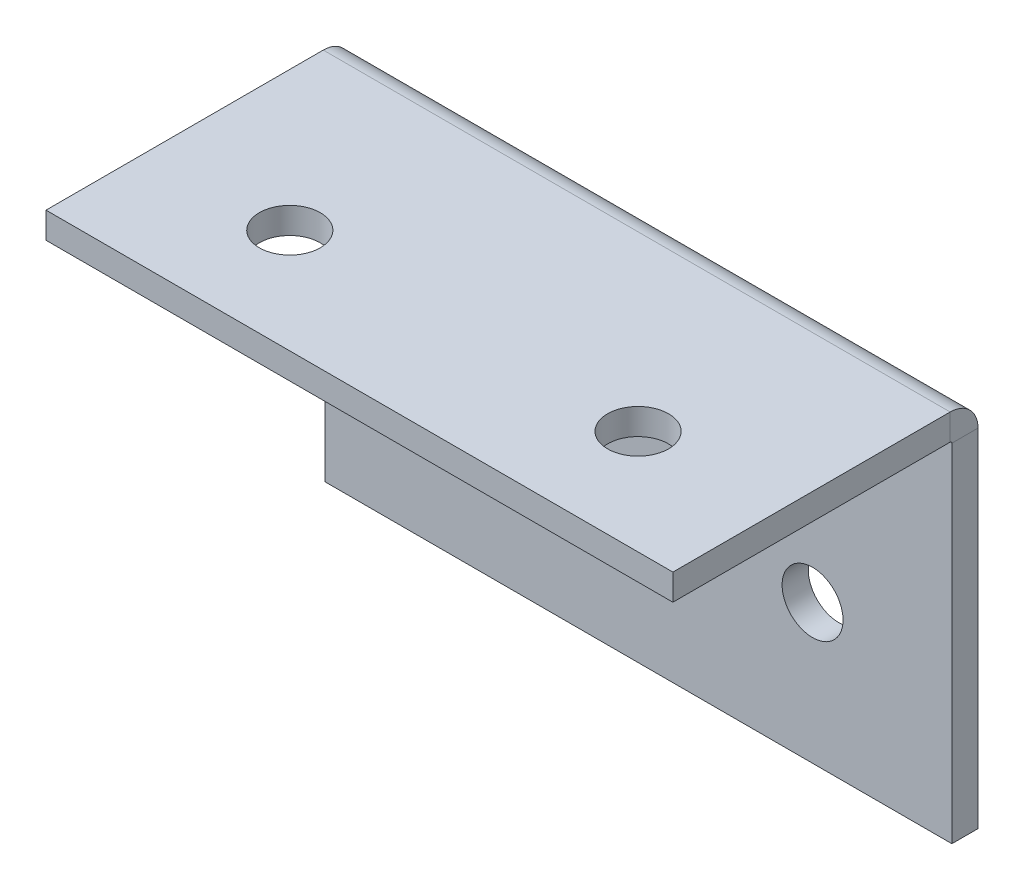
ISO-10303-21;
HEADER;
FILE_DESCRIPTION(('STEP AP214'),'2;1');
FILE_NAME('part.step','',(''),(''),'','','');
FILE_SCHEMA(('AUTOMOTIVE_DESIGN { 1 0 10303 214 1 1 1 1 }'));
ENDSEC;
DATA;
#1=APPLICATION_CONTEXT('core data for automotive mechanical design processes');
#2=APPLICATION_PROTOCOL_DEFINITION('international standard','automotive_design',2000,#1);
#3=PRODUCT_CONTEXT('',#1,'mechanical');
#4=PRODUCT('Part','Part','',(#3));
#5=PRODUCT_RELATED_PRODUCT_CATEGORY('part','',(#4));
#6=PRODUCT_DEFINITION_FORMATION('','',#4);
#7=PRODUCT_DEFINITION_CONTEXT('part definition',#1,'design');
#8=PRODUCT_DEFINITION('design','',#6,#7);
#9=PRODUCT_DEFINITION_SHAPE('','',#8);
#10=(LENGTH_UNIT() NAMED_UNIT(*) SI_UNIT(.MILLI.,.METRE.));
#11=(NAMED_UNIT(*) PLANE_ANGLE_UNIT() SI_UNIT($,.RADIAN.));
#12=(NAMED_UNIT(*) SI_UNIT($,.STERADIAN.) SOLID_ANGLE_UNIT());
#13=UNCERTAINTY_MEASURE_WITH_UNIT(LENGTH_MEASURE(1.E-05),#10,'distance_accuracy_value','');
#14=(GEOMETRIC_REPRESENTATION_CONTEXT(3) GLOBAL_UNCERTAINTY_ASSIGNED_CONTEXT((#13)) GLOBAL_UNIT_ASSIGNED_CONTEXT((#10,
#11,#12)) REPRESENTATION_CONTEXT('',''));
#15=CARTESIAN_POINT('',(0.,0.,0.));
#16=DIRECTION('',(0.,0.,1.));
#17=DIRECTION('',(1.,0.,0.));
#18=AXIS2_PLACEMENT_3D('',#15,#16,#17);
#19=CARTESIAN_POINT('',(0.,20.0214484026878,16.0214484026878));
#20=DIRECTION('',(0.,1.,0.));
#21=DIRECTION('',(-1.,0.,0.));
#22=AXIS2_PLACEMENT_3D('',#19,#20,#21);
#23=PLANE('',#22);
#24=CARTESIAN_POINT('',(8.,20.0214484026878,10.0214484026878));
#25=DIRECTION('',(0.,-1.,0.));
#26=DIRECTION('',(1.,0.,0.));
#27=AXIS2_PLACEMENT_3D('',#24,#25,#26);
#28=CIRCLE('',#27,1.75);
#29=CARTESIAN_POINT('',(9.75,20.0214484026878,10.0214484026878));
#30=VERTEX_POINT('',#29);
#31=EDGE_CURVE('E162',#30,#30,#28,.T.);
#32=ORIENTED_EDGE('',*,*,#31,.F.);
#33=EDGE_LOOP('',(#32));
#34=FACE_BOUND('',#33,.T.);
#35=CARTESIAN_POINT('',(28.,20.0214484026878,10.0214484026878));
#36=DIRECTION('',(0.,-1.,0.));
#37=DIRECTION('',(1.,0.,0.));
#38=AXIS2_PLACEMENT_3D('',#35,#36,#37);
#39=CIRCLE('',#38,1.75);
#40=CARTESIAN_POINT('',(29.75,20.0214484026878,10.0214484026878));
#41=VERTEX_POINT('',#40);
#42=EDGE_CURVE('E163',#41,#41,#39,.T.);
#43=ORIENTED_EDGE('',*,*,#42,.F.);
#44=EDGE_LOOP('',(#43));
#45=FACE_BOUND('',#44,.T.);
#46=DIRECTION('',(0.,0.,-1.));
#47=VECTOR('',#46,1.);
#48=CARTESIAN_POINT('',(0.,20.0214484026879,-19.9785515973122));
#49=LINE('',#48,#47);
#50=CARTESIAN_POINT('',(0.,20.0214484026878,16.0214484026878));
#51=VERTEX_POINT('',#50);
#52=CARTESIAN_POINT('',(0.,20.0214484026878,0.099999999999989));
#53=VERTEX_POINT('',#52);
#54=EDGE_CURVE('E53',#51,#53,#49,.T.);
#55=ORIENTED_EDGE('',*,*,#54,.T.);
#56=DIRECTION('',(1.,0.,0.));
#57=VECTOR('',#56,1.);
#58=CARTESIAN_POINT('',(0.,20.0214484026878,0.099999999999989));
#59=LINE('',#58,#57);
#60=CARTESIAN_POINT('',(36.,20.0214484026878,0.099999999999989));
#61=VERTEX_POINT('',#60);
#62=EDGE_CURVE('E45',#53,#61,#59,.T.);
#63=ORIENTED_EDGE('',*,*,#62,.T.);
#64=DIRECTION('',(0.,0.,1.));
#65=VECTOR('',#64,1.);
#66=CARTESIAN_POINT('',(36.,20.0214484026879,-19.9785515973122));
#67=LINE('',#66,#65);
#68=CARTESIAN_POINT('',(36.,20.0214484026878,16.0214484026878));
#69=VERTEX_POINT('',#68);
#70=EDGE_CURVE('E61',#61,#69,#67,.T.);
#71=ORIENTED_EDGE('',*,*,#70,.T.);
#72=DIRECTION('',(-1.,0.,0.));
#73=VECTOR('',#72,1.);
#74=CARTESIAN_POINT('',(0.,20.0214484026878,16.0214484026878));
#75=LINE('',#74,#73);
#76=EDGE_CURVE('E176',#69,#51,#75,.T.);
#77=ORIENTED_EDGE('',*,*,#76,.T.);
#78=EDGE_LOOP('',(#55,#63,#71,#77));
#79=FACE_BOUND('',#78,.T.);
#80=ADVANCED_FACE('F36',(#34,#45,#79),#23,.F.);
#81=CARTESIAN_POINT('',(0.,21.5214484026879,-19.9785515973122));
#82=DIRECTION('',(-1.,0.,0.));
#83=DIRECTION('',(0.,-1.,0.));
#84=AXIS2_PLACEMENT_3D('',#81,#82,#83);
#85=PLANE('',#84);
#86=DIRECTION('',(0.,1.,0.));
#87=VECTOR('',#86,1.);
#88=CARTESIAN_POINT('',(0.,21.5214484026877,0.100000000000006));
#89=LINE('',#88,#87);
#90=CARTESIAN_POINT('',(0.,21.5214484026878,0.100000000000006));
#91=VERTEX_POINT('',#90);
#92=EDGE_CURVE('E12',#53,#91,#89,.T.);
#93=ORIENTED_EDGE('',*,*,#92,.F.);
#94=ORIENTED_EDGE('',*,*,#54,.F.);
#95=DIRECTION('',(0.,-1.,0.));
#96=VECTOR('',#95,1.);
#97=CARTESIAN_POINT('',(0.,21.5214484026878,16.0214484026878));
#98=LINE('',#97,#96);
#99=CARTESIAN_POINT('',(0.,21.5214484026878,16.0214484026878));
#100=VERTEX_POINT('',#99);
#101=EDGE_CURVE('E179',#100,#51,#98,.T.);
#102=ORIENTED_EDGE('',*,*,#101,.F.);
#103=DIRECTION('',(0.,0.,-1.));
#104=VECTOR('',#103,1.);
#105=CARTESIAN_POINT('',(0.,21.5214484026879,-19.9785515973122));
#106=LINE('',#105,#104);
#107=EDGE_CURVE('E178',#100,#91,#106,.T.);
#108=ORIENTED_EDGE('',*,*,#107,.T.);
#109=EDGE_LOOP('',(#93,#94,#102,#108));
#110=FACE_BOUND('',#109,.T.);
#111=ADVANCED_FACE('F38',(#110),#85,.T.);
#112=CARTESIAN_POINT('',(0.,21.5214484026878,16.0214484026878));
#113=DIRECTION('',(0.,0.,1.));
#114=DIRECTION('',(0.,-1.,0.));
#115=AXIS2_PLACEMENT_3D('',#112,#113,#114);
#116=PLANE('',#115);
#117=ORIENTED_EDGE('',*,*,#76,.F.);
#118=DIRECTION('',(0.,-1.,0.));
#119=VECTOR('',#118,1.);
#120=CARTESIAN_POINT('',(36.,21.5214484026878,16.0214484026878));
#121=LINE('',#120,#119);
#122=CARTESIAN_POINT('',(36.,21.5214484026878,16.0214484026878));
#123=VERTEX_POINT('',#122);
#124=EDGE_CURVE('E175',#123,#69,#121,.T.);
#125=ORIENTED_EDGE('',*,*,#124,.F.);
#126=DIRECTION('',(-1.,0.,0.));
#127=VECTOR('',#126,1.);
#128=CARTESIAN_POINT('',(0.,21.5214484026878,16.0214484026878));
#129=LINE('',#128,#127);
#130=EDGE_CURVE('E172',#123,#100,#129,.T.);
#131=ORIENTED_EDGE('',*,*,#130,.T.);
#132=ORIENTED_EDGE('',*,*,#101,.T.);
#133=EDGE_LOOP('',(#117,#125,#131,#132));
#134=FACE_BOUND('',#133,.T.);
#135=ADVANCED_FACE('F195',(#134),#116,.T.);
#136=CARTESIAN_POINT('',(36.,21.5214484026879,-19.9785515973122));
#137=DIRECTION('',(1.,0.,0.));
#138=DIRECTION('',(0.,1.,0.));
#139=AXIS2_PLACEMENT_3D('',#136,#137,#138);
#140=PLANE('',#139);
#141=DIRECTION('',(0.,-1.,0.));
#142=VECTOR('',#141,1.);
#143=CARTESIAN_POINT('',(36.,21.5214484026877,0.100000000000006));
#144=LINE('',#143,#142);
#145=CARTESIAN_POINT('',(36.,21.5214484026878,0.100000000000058));
#146=VERTEX_POINT('',#145);
#147=EDGE_CURVE('E183',#146,#61,#144,.T.);
#148=ORIENTED_EDGE('',*,*,#147,.F.);
#149=DIRECTION('',(0.,0.,1.));
#150=VECTOR('',#149,1.);
#151=CARTESIAN_POINT('',(36.,21.5214484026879,-19.9785515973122));
#152=LINE('',#151,#150);
#153=EDGE_CURVE('E40',#146,#123,#152,.T.);
#154=ORIENTED_EDGE('',*,*,#153,.T.);
#155=ORIENTED_EDGE('',*,*,#124,.T.);
#156=ORIENTED_EDGE('',*,*,#70,.F.);
#157=EDGE_LOOP('',(#148,#154,#155,#156));
#158=FACE_BOUND('',#157,.T.);
#159=ADVANCED_FACE('F191',(#158),#140,.T.);
#160=CARTESIAN_POINT('',(0.,21.5214484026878,16.0214484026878));
#161=DIRECTION('',(0.,1.,0.));
#162=DIRECTION('',(-1.,0.,0.));
#163=AXIS2_PLACEMENT_3D('',#160,#161,#162);
#164=PLANE('',#163);
#165=DIRECTION('',(1.,0.,0.));
#166=VECTOR('',#165,1.);
#167=CARTESIAN_POINT('',(0.,21.5214484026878,0.100000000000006));
#168=LINE('',#167,#166);
#169=EDGE_CURVE('E125',#91,#146,#168,.T.);
#170=ORIENTED_EDGE('',*,*,#169,.F.);
#171=ORIENTED_EDGE('',*,*,#107,.F.);
#172=ORIENTED_EDGE('',*,*,#130,.F.);
#173=ORIENTED_EDGE('',*,*,#153,.F.);
#174=EDGE_LOOP('',(#170,#171,#172,#173));
#175=FACE_BOUND('',#174,.T.);
#176=CARTESIAN_POINT('',(28.,21.5214484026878,10.0214484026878));
#177=DIRECTION('',(0.,-1.,0.));
#178=DIRECTION('',(1.,0.,0.));
#179=AXIS2_PLACEMENT_3D('',#176,#177,#178);
#180=CIRCLE('',#179,1.75);
#181=CARTESIAN_POINT('',(29.75,21.5214484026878,10.0214484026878));
#182=VERTEX_POINT('',#181);
#183=EDGE_CURVE('E159',#182,#182,#180,.T.);
#184=ORIENTED_EDGE('',*,*,#183,.T.);
#185=EDGE_LOOP('',(#184));
#186=FACE_BOUND('',#185,.T.);
#187=CARTESIAN_POINT('',(8.,21.5214484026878,10.0214484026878));
#188=DIRECTION('',(0.,-1.,0.));
#189=DIRECTION('',(1.,0.,0.));
#190=AXIS2_PLACEMENT_3D('',#187,#188,#189);
#191=CIRCLE('',#190,1.75);
#192=CARTESIAN_POINT('',(9.75,21.5214484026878,10.0214484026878));
#193=VERTEX_POINT('',#192);
#194=EDGE_CURVE('E167',#193,#193,#191,.T.);
#195=ORIENTED_EDGE('',*,*,#194,.T.);
#196=EDGE_LOOP('',(#195));
#197=FACE_BOUND('',#196,.T.);
#198=ADVANCED_FACE('F255',(#175,#186,#197),#164,.T.);
#199=CARTESIAN_POINT('',(8.,21.5214484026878,10.0214484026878));
#200=DIRECTION('',(0.,-1.,0.));
#201=DIRECTION('',(1.,0.,0.));
#202=AXIS2_PLACEMENT_3D('',#199,#200,#201);
#203=CYLINDRICAL_SURFACE('',#202,1.75);
#204=ORIENTED_EDGE('',*,*,#194,.F.);
#205=EDGE_LOOP('',(#204));
#206=FACE_BOUND('',#205,.T.);
#207=ORIENTED_EDGE('',*,*,#31,.T.);
#208=EDGE_LOOP('',(#207));
#209=FACE_BOUND('',#208,.T.);
#210=ADVANCED_FACE('F241',(#206,#209),#203,.F.);
#211=CARTESIAN_POINT('',(28.,21.5214484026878,10.0214484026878));
#212=DIRECTION('',(0.,-1.,0.));
#213=DIRECTION('',(1.,0.,0.));
#214=AXIS2_PLACEMENT_3D('',#211,#212,#213);
#215=CYLINDRICAL_SURFACE('',#214,1.75);
#216=ORIENTED_EDGE('',*,*,#183,.F.);
#217=EDGE_LOOP('',(#216));
#218=FACE_BOUND('',#217,.T.);
#219=ORIENTED_EDGE('',*,*,#42,.T.);
#220=EDGE_LOOP('',(#219));
#221=FACE_BOUND('',#220,.T.);
#222=ADVANCED_FACE('F232',(#218,#221),#215,.F.);
#223=CARTESIAN_POINT('',(0.,0.,-1.5));
#224=DIRECTION('',(0.,-1.,0.));
#225=DIRECTION('',(0.,0.,-1.));
#226=AXIS2_PLACEMENT_3D('',#223,#224,#225);
#227=PLANE('',#226);
#228=DIRECTION('',(1.,0.,0.));
#229=VECTOR('',#228,1.);
#230=CARTESIAN_POINT('',(0.,0.,0.));
#231=LINE('',#230,#229);
#232=CARTESIAN_POINT('',(0.,0.,0.));
#233=VERTEX_POINT('',#232);
#234=CARTESIAN_POINT('',(36.,0.,0.));
#235=VERTEX_POINT('',#234);
#236=EDGE_CURVE('E218',#233,#235,#231,.T.);
#237=ORIENTED_EDGE('',*,*,#236,.F.);
#238=DIRECTION('',(0.,0.,1.));
#239=VECTOR('',#238,1.);
#240=CARTESIAN_POINT('',(0.,0.,-1.5));
#241=LINE('',#240,#239);
#242=CARTESIAN_POINT('',(0.,0.,-1.5));
#243=VERTEX_POINT('',#242);
#244=EDGE_CURVE('E166',#243,#233,#241,.T.);
#245=ORIENTED_EDGE('',*,*,#244,.F.);
#246=DIRECTION('',(1.,0.,0.));
#247=VECTOR('',#246,1.);
#248=CARTESIAN_POINT('',(0.,0.,-1.5));
#249=LINE('',#248,#247);
#250=CARTESIAN_POINT('',(36.,0.,-1.5));
#251=VERTEX_POINT('',#250);
#252=EDGE_CURVE('E156',#243,#251,#249,.T.);
#253=ORIENTED_EDGE('',*,*,#252,.T.);
#254=DIRECTION('',(0.,0.,1.));
#255=VECTOR('',#254,1.);
#256=CARTESIAN_POINT('',(36.,0.,-1.5));
#257=LINE('',#256,#255);
#258=EDGE_CURVE('E140',#251,#235,#257,.T.);
#259=ORIENTED_EDGE('',*,*,#258,.T.);
#260=EDGE_LOOP('',(#237,#245,#253,#259));
#261=FACE_BOUND('',#260,.T.);
#262=ADVANCED_FACE('F229',(#261),#227,.T.);
#263=CARTESIAN_POINT('',(28.,8.,-1.5));
#264=DIRECTION('',(0.,0.,1.));
#265=DIRECTION('',(1.,0.,0.));
#266=AXIS2_PLACEMENT_3D('',#263,#264,#265);
#267=CYLINDRICAL_SURFACE('',#266,1.75);
#268=CARTESIAN_POINT('',(28.,8.,-1.5));
#269=DIRECTION('',(0.,0.,1.));
#270=DIRECTION('',(1.,0.,0.));
#271=AXIS2_PLACEMENT_3D('',#268,#269,#270);
#272=CIRCLE('',#271,1.75);
#273=CARTESIAN_POINT('',(29.75,8.,-1.5));
#274=VERTEX_POINT('',#273);
#275=EDGE_CURVE('E137',#274,#274,#272,.T.);
#276=ORIENTED_EDGE('',*,*,#275,.F.);
#277=EDGE_LOOP('',(#276));
#278=FACE_BOUND('',#277,.T.);
#279=CARTESIAN_POINT('',(28.,8.,0.));
#280=DIRECTION('',(0.,0.,1.));
#281=DIRECTION('',(1.,0.,0.));
#282=AXIS2_PLACEMENT_3D('',#279,#280,#281);
#283=CIRCLE('',#282,1.75);
#284=CARTESIAN_POINT('',(29.75,8.,0.));
#285=VERTEX_POINT('',#284);
#286=EDGE_CURVE('E152',#285,#285,#283,.T.);
#287=ORIENTED_EDGE('',*,*,#286,.T.);
#288=EDGE_LOOP('',(#287));
#289=FACE_BOUND('',#288,.T.);
#290=ADVANCED_FACE('F231',(#278,#289),#267,.F.);
#291=CARTESIAN_POINT('',(8.,8.,-1.5));
#292=DIRECTION('',(0.,0.,1.));
#293=DIRECTION('',(1.,0.,0.));
#294=AXIS2_PLACEMENT_3D('',#291,#292,#293);
#295=CYLINDRICAL_SURFACE('',#294,1.75);
#296=CARTESIAN_POINT('',(8.,8.,-1.5));
#297=DIRECTION('',(0.,0.,1.));
#298=DIRECTION('',(1.,0.,0.));
#299=AXIS2_PLACEMENT_3D('',#296,#297,#298);
#300=CIRCLE('',#299,1.75);
#301=CARTESIAN_POINT('',(9.75,8.,-1.5));
#302=VERTEX_POINT('',#301);
#303=EDGE_CURVE('E146',#302,#302,#300,.T.);
#304=ORIENTED_EDGE('',*,*,#303,.F.);
#305=EDGE_LOOP('',(#304));
#306=FACE_BOUND('',#305,.T.);
#307=CARTESIAN_POINT('',(8.,8.,0.));
#308=DIRECTION('',(0.,0.,1.));
#309=DIRECTION('',(1.,0.,0.));
#310=AXIS2_PLACEMENT_3D('',#307,#308,#309);
#311=CIRCLE('',#310,1.75);
#312=CARTESIAN_POINT('',(9.75,8.,0.));
#313=VERTEX_POINT('',#312);
#314=EDGE_CURVE('E149',#313,#313,#311,.T.);
#315=ORIENTED_EDGE('',*,*,#314,.T.);
#316=EDGE_LOOP('',(#315));
#317=FACE_BOUND('',#316,.T.);
#318=ADVANCED_FACE('F238',(#306,#317),#295,.F.);
#319=CARTESIAN_POINT('',(0.,36.,-1.5));
#320=DIRECTION('',(0.,0.,-1.));
#321=DIRECTION('',(-1.,0.,0.));
#322=AXIS2_PLACEMENT_3D('',#319,#320,#321);
#323=PLANE('',#322);
#324=ORIENTED_EDGE('',*,*,#303,.T.);
#325=EDGE_LOOP('',(#324));
#326=FACE_BOUND('',#325,.T.);
#327=ORIENTED_EDGE('',*,*,#275,.T.);
#328=EDGE_LOOP('',(#327));
#329=FACE_BOUND('',#328,.T.);
#330=DIRECTION('',(0.,-1.,0.));
#331=VECTOR('',#330,1.);
#332=CARTESIAN_POINT('',(0.,0.,-1.5));
#333=LINE('',#332,#331);
#334=CARTESIAN_POINT('',(0.,19.9214484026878,-1.5));
#335=VERTEX_POINT('',#334);
#336=EDGE_CURVE('E135',#335,#243,#333,.T.);
#337=ORIENTED_EDGE('',*,*,#336,.F.);
#338=DIRECTION('',(1.,0.,0.));
#339=VECTOR('',#338,1.);
#340=CARTESIAN_POINT('',(0.,19.9214484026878,-1.5));
#341=LINE('',#340,#339);
#342=CARTESIAN_POINT('',(36.,19.9214484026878,-1.5));
#343=VERTEX_POINT('',#342);
#344=EDGE_CURVE('E123',#335,#343,#341,.T.);
#345=ORIENTED_EDGE('',*,*,#344,.T.);
#346=DIRECTION('',(0.,1.,0.));
#347=VECTOR('',#346,1.);
#348=CARTESIAN_POINT('',(36.,0.,-1.5));
#349=LINE('',#348,#347);
#350=EDGE_CURVE('E116',#251,#343,#349,.T.);
#351=ORIENTED_EDGE('',*,*,#350,.F.);
#352=ORIENTED_EDGE('',*,*,#252,.F.);
#353=EDGE_LOOP('',(#337,#345,#351,#352));
#354=FACE_BOUND('',#353,.T.);
#355=ADVANCED_FACE('F132',(#326,#329,#354),#323,.T.);
#356=CARTESIAN_POINT('',(36.,0.,-1.5));
#357=DIRECTION('',(1.,0.,0.));
#358=DIRECTION('',(0.,0.,-1.));
#359=AXIS2_PLACEMENT_3D('',#356,#357,#358);
#360=PLANE('',#359);
#361=ORIENTED_EDGE('',*,*,#350,.T.);
#362=DIRECTION('',(0.,0.,1.));
#363=VECTOR('',#362,1.);
#364=CARTESIAN_POINT('',(36.,19.9214484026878,-1.49999999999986));
#365=LINE('',#364,#363);
#366=CARTESIAN_POINT('',(36.,19.9214484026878,0.));
#367=VERTEX_POINT('',#366);
#368=EDGE_CURVE('E104',#343,#367,#365,.T.);
#369=ORIENTED_EDGE('',*,*,#368,.T.);
#370=DIRECTION('',(0.,1.,0.));
#371=VECTOR('',#370,1.);
#372=CARTESIAN_POINT('',(36.,0.,0.));
#373=LINE('',#372,#371);
#374=EDGE_CURVE('E215',#235,#367,#373,.T.);
#375=ORIENTED_EDGE('',*,*,#374,.F.);
#376=ORIENTED_EDGE('',*,*,#258,.F.);
#377=EDGE_LOOP('',(#361,#369,#375,#376));
#378=FACE_BOUND('',#377,.T.);
#379=ADVANCED_FACE('F139',(#378),#360,.T.);
#380=CARTESIAN_POINT('',(0.,36.,0.));
#381=DIRECTION('',(0.,0.,-1.));
#382=DIRECTION('',(-1.,0.,0.));
#383=AXIS2_PLACEMENT_3D('',#380,#381,#382);
#384=PLANE('',#383);
#385=DIRECTION('',(1.,0.,0.));
#386=VECTOR('',#385,1.);
#387=CARTESIAN_POINT('',(0.,19.9214484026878,0.));
#388=LINE('',#387,#386);
#389=CARTESIAN_POINT('',(0.,19.9214484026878,0.));
#390=VERTEX_POINT('',#389);
#391=EDGE_CURVE('E126',#390,#367,#388,.T.);
#392=ORIENTED_EDGE('',*,*,#391,.F.);
#393=DIRECTION('',(0.,-1.,0.));
#394=VECTOR('',#393,1.);
#395=CARTESIAN_POINT('',(0.,0.,0.));
#396=LINE('',#395,#394);
#397=EDGE_CURVE('E115',#390,#233,#396,.T.);
#398=ORIENTED_EDGE('',*,*,#397,.T.);
#399=ORIENTED_EDGE('',*,*,#236,.T.);
#400=ORIENTED_EDGE('',*,*,#374,.T.);
#401=EDGE_LOOP('',(#392,#398,#399,#400));
#402=FACE_BOUND('',#401,.T.);
#403=ORIENTED_EDGE('',*,*,#314,.F.);
#404=EDGE_LOOP('',(#403));
#405=FACE_BOUND('',#404,.T.);
#406=ORIENTED_EDGE('',*,*,#286,.F.);
#407=EDGE_LOOP('',(#406));
#408=FACE_BOUND('',#407,.T.);
#409=ADVANCED_FACE('F222',(#402,#405,#408),#384,.F.);
#410=CARTESIAN_POINT('',(0.,0.,-1.5));
#411=DIRECTION('',(-1.,0.,0.));
#412=DIRECTION('',(0.,0.,1.));
#413=AXIS2_PLACEMENT_3D('',#410,#411,#412);
#414=PLANE('',#413);
#415=ORIENTED_EDGE('',*,*,#397,.F.);
#416=DIRECTION('',(0.,0.,-1.));
#417=VECTOR('',#416,1.);
#418=CARTESIAN_POINT('',(0.,19.9214484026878,-1.49999999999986));
#419=LINE('',#418,#417);
#420=EDGE_CURVE('E206',#390,#335,#419,.T.);
#421=ORIENTED_EDGE('',*,*,#420,.T.);
#422=ORIENTED_EDGE('',*,*,#336,.T.);
#423=ORIENTED_EDGE('',*,*,#244,.T.);
#424=EDGE_LOOP('',(#415,#421,#422,#423));
#425=FACE_BOUND('',#424,.T.);
#426=ADVANCED_FACE('F227',(#425),#414,.T.);
#427=CARTESIAN_POINT('',(0.,19.9214484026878,0.1));
#428=DIRECTION('',(-1.,0.,0.));
#429=DIRECTION('',(0.,0.,1.));
#430=AXIS2_PLACEMENT_3D('',#427,#428,#429);
#431=PLANE('',#430);
#432=ORIENTED_EDGE('',*,*,#420,.F.);
#433=CARTESIAN_POINT('',(0.,19.9214484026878,0.1));
#434=DIRECTION('',(1.,0.,0.));
#435=DIRECTION('',(0.,0.,-1.));
#436=AXIS2_PLACEMENT_3D('',#433,#434,#435);
#437=CIRCLE('',#436,0.1);
#438=EDGE_CURVE('E203',#390,#53,#437,.T.);
#439=ORIENTED_EDGE('',*,*,#438,.T.);
#440=ORIENTED_EDGE('',*,*,#92,.T.);
#441=CARTESIAN_POINT('',(0.,19.9214484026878,0.1));
#442=DIRECTION('',(1.,0.,0.));
#443=DIRECTION('',(0.,0.,1.));
#444=AXIS2_PLACEMENT_3D('',#441,#442,#443);
#445=CIRCLE('',#444,1.6);
#446=EDGE_CURVE('E127',#335,#91,#445,.T.);
#447=ORIENTED_EDGE('',*,*,#446,.F.);
#448=EDGE_LOOP('',(#432,#439,#440,#447));
#449=FACE_BOUND('',#448,.T.);
#450=ADVANCED_FACE('F205',(#449),#431,.T.);
#451=CARTESIAN_POINT('',(36.,19.9214484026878,0.1));
#452=DIRECTION('',(1.,0.,0.));
#453=DIRECTION('',(0.,0.,-1.));
#454=AXIS2_PLACEMENT_3D('',#451,#452,#453);
#455=PLANE('',#454);
#456=CARTESIAN_POINT('',(36.,19.9214484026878,0.1));
#457=DIRECTION('',(1.,0.,0.));
#458=DIRECTION('',(0.,0.,-1.));
#459=AXIS2_PLACEMENT_3D('',#456,#457,#458);
#460=CIRCLE('',#459,0.1);
#461=EDGE_CURVE('E110',#61,#367,#460,.F.);
#462=ORIENTED_EDGE('',*,*,#461,.T.);
#463=ORIENTED_EDGE('',*,*,#368,.F.);
#464=CARTESIAN_POINT('',(36.,19.9214484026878,0.1));
#465=DIRECTION('',(-1.,0.,0.));
#466=DIRECTION('',(0.,0.,-1.));
#467=AXIS2_PLACEMENT_3D('',#464,#465,#466);
#468=CIRCLE('',#467,1.6);
#469=EDGE_CURVE('E108',#146,#343,#468,.T.);
#470=ORIENTED_EDGE('',*,*,#469,.F.);
#471=ORIENTED_EDGE('',*,*,#147,.T.);
#472=EDGE_LOOP('',(#462,#463,#470,#471));
#473=FACE_BOUND('',#472,.T.);
#474=ADVANCED_FACE('F106',(#473),#455,.T.);
#475=CARTESIAN_POINT('',(-18.0315789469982,19.9214484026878,0.1));
#476=DIRECTION('',(1.,0.,0.));
#477=DIRECTION('',(0.,0.,-1.));
#478=AXIS2_PLACEMENT_3D('',#475,#476,#477);
#479=CYLINDRICAL_SURFACE('',#478,1.6);
#480=ORIENTED_EDGE('',*,*,#169,.T.);
#481=ORIENTED_EDGE('',*,*,#469,.T.);
#482=ORIENTED_EDGE('',*,*,#344,.F.);
#483=ORIENTED_EDGE('',*,*,#446,.T.);
#484=EDGE_LOOP('',(#480,#481,#482,#483));
#485=FACE_BOUND('',#484,.T.);
#486=ADVANCED_FACE('F121',(#485),#479,.T.);
#487=CARTESIAN_POINT('',(-18.0315789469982,19.9214484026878,0.1));
#488=DIRECTION('',(1.,0.,0.));
#489=DIRECTION('',(0.,0.,-1.));
#490=AXIS2_PLACEMENT_3D('',#487,#488,#489);
#491=CYLINDRICAL_SURFACE('',#490,0.1);
#492=ORIENTED_EDGE('',*,*,#62,.F.);
#493=ORIENTED_EDGE('',*,*,#438,.F.);
#494=ORIENTED_EDGE('',*,*,#391,.T.);
#495=ORIENTED_EDGE('',*,*,#461,.F.);
#496=EDGE_LOOP('',(#492,#493,#494,#495));
#497=FACE_BOUND('',#496,.T.);
#498=ADVANCED_FACE('F202',(#497),#491,.F.);
#499=CLOSED_SHELL('',(#80,#111,#135,#159,#198,#210,#222,#262,#290,#318,#355,#379,#409,#426,#450,
#474,#486,#498));
#500=MANIFOLD_SOLID_BREP('B2',#499);
#501=ADVANCED_BREP_SHAPE_REPRESENTATION('',(#18,#500),#14);
#502=SHAPE_DEFINITION_REPRESENTATION(#9,#501);
ENDSEC;
END-ISO-10303-21;
